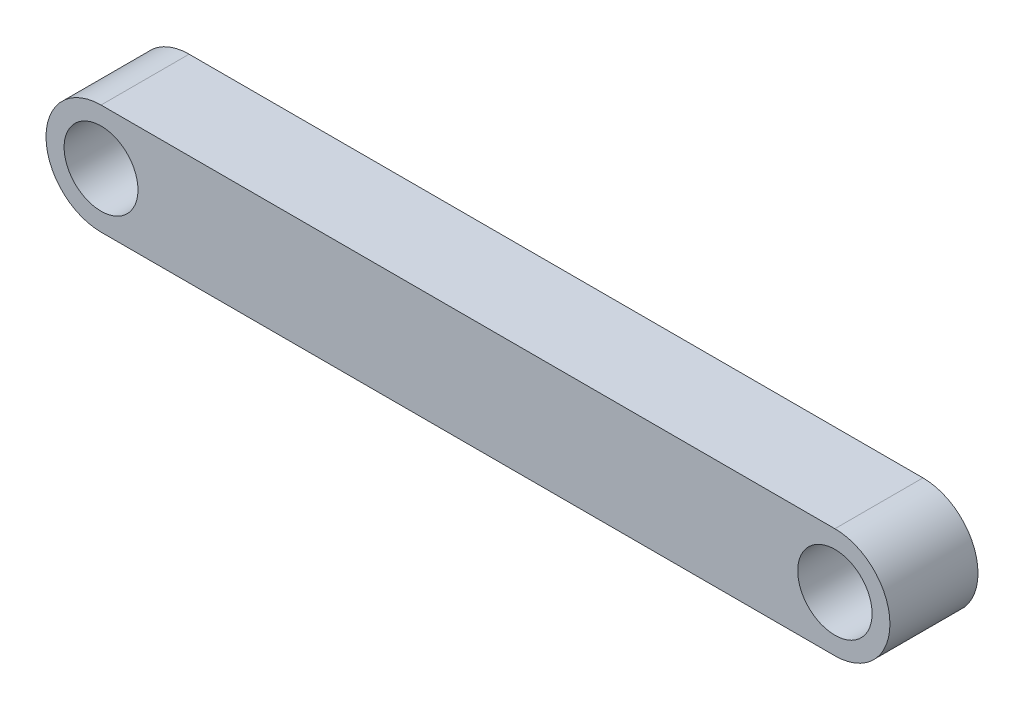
ISO-10303-21;
HEADER;
FILE_DESCRIPTION(('STEP AP214'),'2;1');
FILE_NAME('part.step','',(''),(''),'','','');
FILE_SCHEMA(('AUTOMOTIVE_DESIGN { 1 0 10303 214 1 1 1 1 }'));
ENDSEC;
DATA;
#1=APPLICATION_CONTEXT('core data for automotive mechanical design processes');
#2=APPLICATION_PROTOCOL_DEFINITION('international standard','automotive_design',2000,#1);
#3=PRODUCT_CONTEXT('',#1,'mechanical');
#4=PRODUCT('Part','Part','',(#3));
#5=PRODUCT_RELATED_PRODUCT_CATEGORY('part','',(#4));
#6=PRODUCT_DEFINITION_FORMATION('','',#4);
#7=PRODUCT_DEFINITION_CONTEXT('part definition',#1,'design');
#8=PRODUCT_DEFINITION('design','',#6,#7);
#9=PRODUCT_DEFINITION_SHAPE('','',#8);
#10=(LENGTH_UNIT() NAMED_UNIT(*) SI_UNIT(.MILLI.,.METRE.));
#11=(NAMED_UNIT(*) PLANE_ANGLE_UNIT() SI_UNIT($,.RADIAN.));
#12=(NAMED_UNIT(*) SI_UNIT($,.STERADIAN.) SOLID_ANGLE_UNIT());
#13=UNCERTAINTY_MEASURE_WITH_UNIT(LENGTH_MEASURE(1.E-05),#10,'distance_accuracy_value','');
#14=(GEOMETRIC_REPRESENTATION_CONTEXT(3) GLOBAL_UNCERTAINTY_ASSIGNED_CONTEXT((#13)) GLOBAL_UNIT_ASSIGNED_CONTEXT((#10,
#11,#12)) REPRESENTATION_CONTEXT('',''));
#15=CARTESIAN_POINT('',(0.,0.,0.));
#16=DIRECTION('',(0.,0.,1.));
#17=DIRECTION('',(1.,0.,0.));
#18=AXIS2_PLACEMENT_3D('',#15,#16,#17);
#19=CARTESIAN_POINT('',(0.,0.,15.24));
#20=DIRECTION('',(0.,1.,0.));
#21=DIRECTION('',(0.,0.,1.));
#22=AXIS2_PLACEMENT_3D('',#19,#20,#21);
#23=PLANE('',#22);
#24=DIRECTION('',(0.,0.,1.));
#25=VECTOR('',#24,1.);
#26=CARTESIAN_POINT('',(63.5,0.,15.24));
#27=LINE('',#26,#25);
#28=CARTESIAN_POINT('',(63.5,0.,0.));
#29=VERTEX_POINT('',#28);
#30=CARTESIAN_POINT('',(63.5,0.,7.62));
#31=VERTEX_POINT('',#30);
#32=EDGE_CURVE('E11',#29,#31,#27,.T.);
#33=ORIENTED_EDGE('',*,*,#32,.F.);
#34=DIRECTION('',(1.,0.,0.));
#35=VECTOR('',#34,1.);
#36=CARTESIAN_POINT('',(0.,0.,0.));
#37=LINE('',#36,#35);
#38=CARTESIAN_POINT('',(127.,0.,0.));
#39=VERTEX_POINT('',#38);
#40=EDGE_CURVE('E94',#29,#39,#37,.T.);
#41=ORIENTED_EDGE('',*,*,#40,.T.);
#42=DIRECTION('',(0.,0.,-1.));
#43=VECTOR('',#42,1.);
#44=CARTESIAN_POINT('',(127.,0.,15.24));
#45=LINE('',#44,#43);
#46=CARTESIAN_POINT('',(127.,0.,15.24));
#47=VERTEX_POINT('',#46);
#48=EDGE_CURVE('E84',#47,#39,#45,.T.);
#49=ORIENTED_EDGE('',*,*,#48,.F.);
#50=DIRECTION('',(1.,0.,0.));
#51=VECTOR('',#50,1.);
#52=CARTESIAN_POINT('',(0.,0.,15.24));
#53=LINE('',#52,#51);
#54=CARTESIAN_POINT('',(0.,0.,15.24));
#55=VERTEX_POINT('',#54);
#56=EDGE_CURVE('E114',#55,#47,#53,.T.);
#57=ORIENTED_EDGE('',*,*,#56,.F.);
#58=DIRECTION('',(0.,0.,-1.));
#59=VECTOR('',#58,1.);
#60=CARTESIAN_POINT('',(0.,0.,15.24));
#61=LINE('',#60,#59);
#62=CARTESIAN_POINT('',(0.,0.,7.62));
#63=VERTEX_POINT('',#62);
#64=EDGE_CURVE('E83',#55,#63,#61,.T.);
#65=ORIENTED_EDGE('',*,*,#64,.T.);
#66=DIRECTION('',(-1.,0.,0.));
#67=VECTOR('',#66,1.);
#68=CARTESIAN_POINT('',(0.,0.,7.62));
#69=LINE('',#68,#67);
#70=EDGE_CURVE('E41',#31,#63,#69,.T.);
#71=ORIENTED_EDGE('',*,*,#70,.F.);
#72=EDGE_LOOP('',(#33,#41,#49,#57,#65,#71));
#73=FACE_BOUND('',#72,.T.);
#74=ADVANCED_FACE('F32',(#73),#23,.F.);
#75=CARTESIAN_POINT('',(0.,9.525,15.24));
#76=DIRECTION('',(0.,0.,1.));
#77=DIRECTION('',(1.,0.,0.));
#78=AXIS2_PLACEMENT_3D('',#75,#76,#77);
#79=PLANE('',#78);
#80=CARTESIAN_POINT('',(127.,9.525,15.24));
#81=DIRECTION('',(0.,0.,1.));
#82=DIRECTION('',(1.,0.,0.));
#83=AXIS2_PLACEMENT_3D('',#80,#81,#82);
#84=CIRCLE('',#83,6.43540000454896);
#85=CARTESIAN_POINT('',(133.435400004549,9.525,15.24));
#86=VERTEX_POINT('',#85);
#87=EDGE_CURVE('E101',#86,#86,#84,.T.);
#88=ORIENTED_EDGE('',*,*,#87,.F.);
#89=EDGE_LOOP('',(#88));
#90=FACE_BOUND('',#89,.T.);
#91=CARTESIAN_POINT('',(0.,9.525,15.24));
#92=DIRECTION('',(0.,0.,1.));
#93=DIRECTION('',(1.,0.,0.));
#94=AXIS2_PLACEMENT_3D('',#91,#92,#93);
#95=CIRCLE('',#94,9.525);
#96=CARTESIAN_POINT('',(0.,19.05,15.24));
#97=VERTEX_POINT('',#96);
#98=EDGE_CURVE('E111',#97,#55,#95,.T.);
#99=ORIENTED_EDGE('',*,*,#98,.T.);
#100=ORIENTED_EDGE('',*,*,#56,.T.);
#101=CARTESIAN_POINT('',(127.,9.525,15.24));
#102=DIRECTION('',(0.,0.,1.));
#103=DIRECTION('',(-1.,0.,0.));
#104=AXIS2_PLACEMENT_3D('',#101,#102,#103);
#105=CIRCLE('',#104,9.525);
#106=CARTESIAN_POINT('',(127.,19.05,15.24));
#107=VERTEX_POINT('',#106);
#108=EDGE_CURVE('E116',#47,#107,#105,.T.);
#109=ORIENTED_EDGE('',*,*,#108,.T.);
#110=DIRECTION('',(-1.,0.,0.));
#111=VECTOR('',#110,1.);
#112=CARTESIAN_POINT('',(0.,19.05,15.24));
#113=LINE('',#112,#111);
#114=EDGE_CURVE('E118',#107,#97,#113,.T.);
#115=ORIENTED_EDGE('',*,*,#114,.T.);
#116=EDGE_LOOP('',(#99,#100,#109,#115));
#117=FACE_BOUND('',#116,.T.);
#118=CARTESIAN_POINT('',(0.,9.525,15.24));
#119=DIRECTION('',(0.,0.,1.));
#120=DIRECTION('',(1.,0.,0.));
#121=AXIS2_PLACEMENT_3D('',#118,#119,#120);
#122=CIRCLE('',#121,6.39058427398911);
#123=CARTESIAN_POINT('',(6.39058427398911,9.525,15.24));
#124=VERTEX_POINT('',#123);
#125=EDGE_CURVE('E174',#124,#124,#122,.T.);
#126=ORIENTED_EDGE('',*,*,#125,.F.);
#127=EDGE_LOOP('',(#126));
#128=FACE_BOUND('',#127,.T.);
#129=ADVANCED_FACE('F133',(#90,#117,#128),#79,.T.);
#130=CARTESIAN_POINT('',(0.,9.525,0.));
#131=DIRECTION('',(0.,0.,1.));
#132=DIRECTION('',(1.,0.,0.));
#133=AXIS2_PLACEMENT_3D('',#130,#131,#132);
#134=PLANE('',#133);
#135=CARTESIAN_POINT('',(127.,9.525,0.));
#136=DIRECTION('',(0.,0.,1.));
#137=DIRECTION('',(1.,0.,0.));
#138=AXIS2_PLACEMENT_3D('',#135,#136,#137);
#139=CIRCLE('',#138,6.43540000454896);
#140=CARTESIAN_POINT('',(133.435400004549,9.525,0.));
#141=VERTEX_POINT('',#140);
#142=EDGE_CURVE('E104',#141,#141,#139,.T.);
#143=ORIENTED_EDGE('',*,*,#142,.T.);
#144=EDGE_LOOP('',(#143));
#145=FACE_BOUND('',#144,.T.);
#146=CARTESIAN_POINT('',(0.,9.525,0.));
#147=DIRECTION('',(0.,0.,1.));
#148=DIRECTION('',(1.,0.,0.));
#149=AXIS2_PLACEMENT_3D('',#146,#147,#148);
#150=CIRCLE('',#149,9.525);
#151=CARTESIAN_POINT('',(0.,19.05,0.));
#152=VERTEX_POINT('',#151);
#153=CARTESIAN_POINT('',(0.,0.,0.));
#154=VERTEX_POINT('',#153);
#155=EDGE_CURVE('E92',#152,#154,#150,.T.);
#156=ORIENTED_EDGE('',*,*,#155,.F.);
#157=DIRECTION('',(-1.,0.,0.));
#158=VECTOR('',#157,1.);
#159=CARTESIAN_POINT('',(0.,19.05,0.));
#160=LINE('',#159,#158);
#161=CARTESIAN_POINT('',(127.,19.05,0.));
#162=VERTEX_POINT('',#161);
#163=EDGE_CURVE('E109',#162,#152,#160,.T.);
#164=ORIENTED_EDGE('',*,*,#163,.F.);
#165=CARTESIAN_POINT('',(127.,9.525,0.));
#166=DIRECTION('',(0.,0.,1.));
#167=DIRECTION('',(-1.,0.,0.));
#168=AXIS2_PLACEMENT_3D('',#165,#166,#167);
#169=CIRCLE('',#168,9.525);
#170=EDGE_CURVE('E95',#39,#162,#169,.T.);
#171=ORIENTED_EDGE('',*,*,#170,.F.);
#172=ORIENTED_EDGE('',*,*,#40,.F.);
#173=EDGE_CURVE('E78',#154,#29,#37,.T.);
#174=ORIENTED_EDGE('',*,*,#173,.F.);
#175=EDGE_LOOP('',(#156,#164,#171,#172,#174));
#176=FACE_BOUND('',#175,.T.);
#177=CARTESIAN_POINT('',(0.,9.525,0.));
#178=DIRECTION('',(0.,0.,1.));
#179=DIRECTION('',(1.,0.,0.));
#180=AXIS2_PLACEMENT_3D('',#177,#178,#179);
#181=CIRCLE('',#180,6.39058427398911);
#182=CARTESIAN_POINT('',(6.39058427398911,9.525,0.));
#183=VERTEX_POINT('',#182);
#184=EDGE_CURVE('E177',#183,#183,#181,.T.);
#185=ORIENTED_EDGE('',*,*,#184,.T.);
#186=EDGE_LOOP('',(#185));
#187=FACE_BOUND('',#186,.T.);
#188=ADVANCED_FACE('F89',(#145,#176,#187),#134,.F.);
#189=CARTESIAN_POINT('',(0.,9.525,15.24));
#190=DIRECTION('',(0.,0.,-1.));
#191=DIRECTION('',(-1.,0.,0.));
#192=AXIS2_PLACEMENT_3D('',#189,#190,#191);
#193=CYLINDRICAL_SURFACE('',#192,9.525);
#194=ORIENTED_EDGE('',*,*,#155,.T.);
#195=EDGE_CURVE('E75',#63,#154,#61,.T.);
#196=ORIENTED_EDGE('',*,*,#195,.F.);
#197=ORIENTED_EDGE('',*,*,#64,.F.);
#198=ORIENTED_EDGE('',*,*,#98,.F.);
#199=DIRECTION('',(0.,0.,-1.));
#200=VECTOR('',#199,1.);
#201=CARTESIAN_POINT('',(0.,19.05,15.24));
#202=LINE('',#201,#200);
#203=EDGE_CURVE('E100',#97,#152,#202,.T.);
#204=ORIENTED_EDGE('',*,*,#203,.T.);
#205=EDGE_LOOP('',(#194,#196,#197,#198,#204));
#206=FACE_BOUND('',#205,.T.);
#207=ADVANCED_FACE('F34',(#206),#193,.T.);
#208=ORIENTED_EDGE('',*,*,#173,.T.);
#209=ORIENTED_EDGE('',*,*,#32,.T.);
#210=ORIENTED_EDGE('',*,*,#70,.T.);
#211=ORIENTED_EDGE('',*,*,#195,.T.);
#212=EDGE_LOOP('',(#208,#209,#210,#211));
#213=FACE_BOUND('',#212,.T.);
#214=ADVANCED_FACE('F77',(#213),#23,.F.);
#215=CARTESIAN_POINT('',(127.,9.525,15.24));
#216=DIRECTION('',(0.,0.,-1.));
#217=DIRECTION('',(-1.,0.,0.));
#218=AXIS2_PLACEMENT_3D('',#215,#216,#217);
#219=CYLINDRICAL_SURFACE('',#218,9.525);
#220=ORIENTED_EDGE('',*,*,#170,.T.);
#221=DIRECTION('',(0.,0.,-1.));
#222=VECTOR('',#221,1.);
#223=CARTESIAN_POINT('',(127.,19.05,15.24));
#224=LINE('',#223,#222);
#225=EDGE_CURVE('E121',#107,#162,#224,.T.);
#226=ORIENTED_EDGE('',*,*,#225,.F.);
#227=ORIENTED_EDGE('',*,*,#108,.F.);
#228=ORIENTED_EDGE('',*,*,#48,.T.);
#229=EDGE_LOOP('',(#220,#226,#227,#228));
#230=FACE_BOUND('',#229,.T.);
#231=ADVANCED_FACE('F141',(#230),#219,.T.);
#232=CARTESIAN_POINT('',(0.,19.05,15.24));
#233=DIRECTION('',(0.,-1.,0.));
#234=DIRECTION('',(0.,0.,-1.));
#235=AXIS2_PLACEMENT_3D('',#232,#233,#234);
#236=PLANE('',#235);
#237=ORIENTED_EDGE('',*,*,#163,.T.);
#238=ORIENTED_EDGE('',*,*,#203,.F.);
#239=ORIENTED_EDGE('',*,*,#114,.F.);
#240=ORIENTED_EDGE('',*,*,#225,.T.);
#241=EDGE_LOOP('',(#237,#238,#239,#240));
#242=FACE_BOUND('',#241,.T.);
#243=ADVANCED_FACE('F139',(#242),#236,.F.);
#244=CARTESIAN_POINT('',(127.,9.525,15.24));
#245=DIRECTION('',(0.,0.,-1.));
#246=DIRECTION('',(-1.,0.,0.));
#247=AXIS2_PLACEMENT_3D('',#244,#245,#246);
#248=CYLINDRICAL_SURFACE('',#247,6.43540000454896);
#249=ORIENTED_EDGE('',*,*,#87,.T.);
#250=EDGE_LOOP('',(#249));
#251=FACE_BOUND('',#250,.T.);
#252=ORIENTED_EDGE('',*,*,#142,.F.);
#253=EDGE_LOOP('',(#252));
#254=FACE_BOUND('',#253,.T.);
#255=ADVANCED_FACE('F148',(#251,#254),#248,.F.);
#256=CARTESIAN_POINT('',(0.,9.525,15.24));
#257=DIRECTION('',(0.,0.,-1.));
#258=DIRECTION('',(-1.,0.,0.));
#259=AXIS2_PLACEMENT_3D('',#256,#257,#258);
#260=CYLINDRICAL_SURFACE('',#259,6.39058427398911);
#261=ORIENTED_EDGE('',*,*,#125,.T.);
#262=EDGE_LOOP('',(#261));
#263=FACE_BOUND('',#262,.T.);
#264=ORIENTED_EDGE('',*,*,#184,.F.);
#265=EDGE_LOOP('',(#264));
#266=FACE_BOUND('',#265,.T.);
#267=ADVANCED_FACE('F165',(#263,#266),#260,.F.);
#268=CLOSED_SHELL('',(#74,#129,#188,#207,#214,#231,#243,#255,#267));
#269=MANIFOLD_SOLID_BREP('B2',#268);
#270=ADVANCED_BREP_SHAPE_REPRESENTATION('',(#18,#269),#14);
#271=SHAPE_DEFINITION_REPRESENTATION(#9,#270);
ENDSEC;
END-ISO-10303-21;
